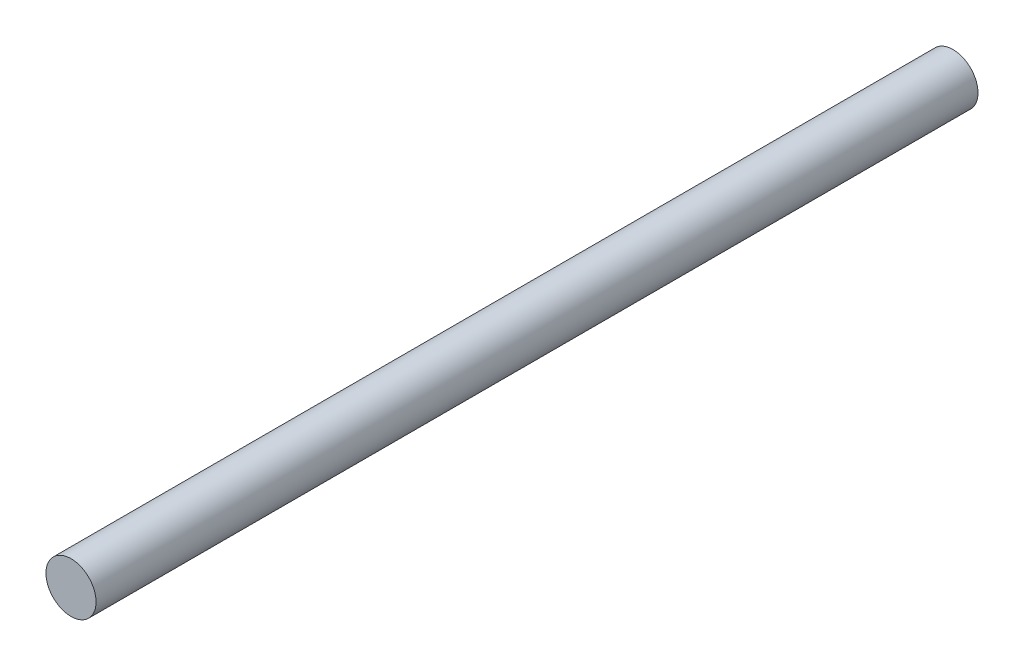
from build123d import *

# Parameters (mm, degrees)
SKETCH1_R           = 1.5875
BOSS_EXTRUDE1_DEPTH = 27.94


with BuildPart() as part:
    # Sketch1 → Boss-Extrude1 (new, symmetric)
    with BuildSketch(Plane.XY):
        Circle(SKETCH1_R)
    extrude(amount=BOSS_EXTRUDE1_DEPTH, both=True)


solid = part.part
